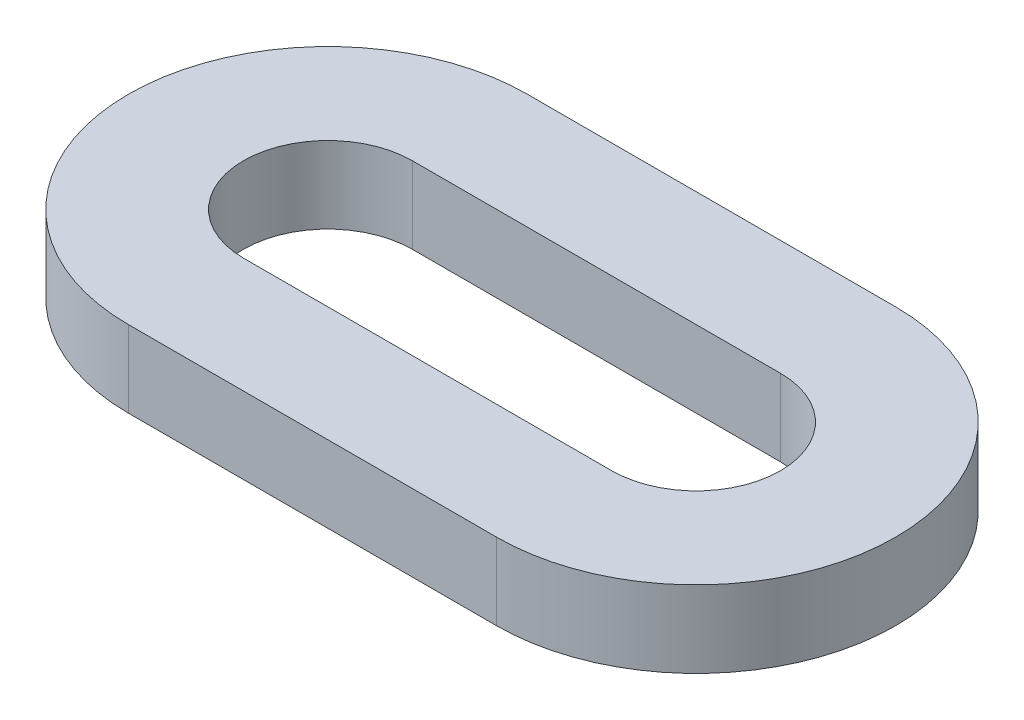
from build123d import *

# Parameters (mm, degrees)
EXTRUDE_1_DEPTH = 10


with BuildPart() as part:
    # Sketch2 → Extrude 1 (new body)
    with BuildSketch(Plane(origin=(0, 0, 0), x_dir=(1, 0, 0), z_dir=(0, 1, 0))):
        with BuildLine():
            Line((-24, 26), (24, 26))
            ThreePointArc((24, 26), (50, 0), (24, -26))
            Line((24, -26), (-24, -26))
            ThreePointArc((-24, -26), (-50, 0), (-24, 26))
        make_face()
        with BuildLine():
            Line((24, -11), (-24, -11))
            ThreePointArc((-24, -11), (-35, 0), (-24, 11))
            Line((-24, 11), (24, 11))
            ThreePointArc((24, 11), (35, 0), (24, -11))
        make_face(mode=Mode.SUBTRACT)
    extrude(amount=EXTRUDE_1_DEPTH)


solid = part.part
